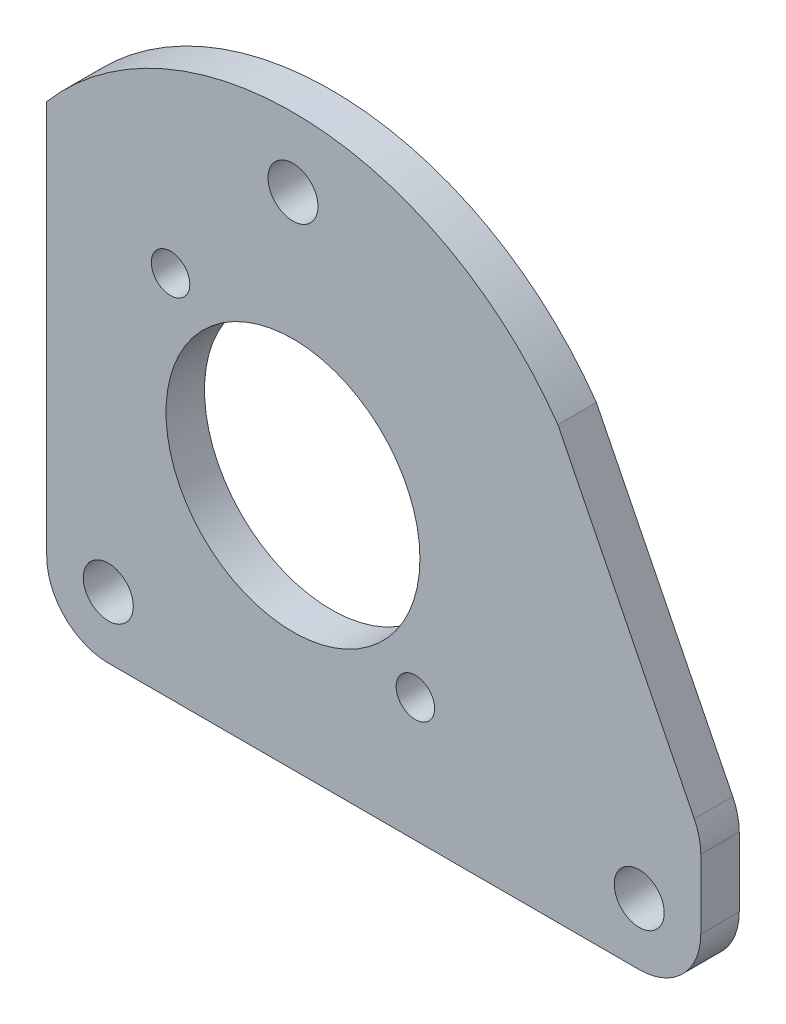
ISO-10303-21;
HEADER;
FILE_DESCRIPTION(('STEP AP214'),'2;1');
FILE_NAME('part.step','',(''),(''),'','','');
FILE_SCHEMA(('AUTOMOTIVE_DESIGN { 1 0 10303 214 1 1 1 1 }'));
ENDSEC;
DATA;
#1=APPLICATION_CONTEXT('core data for automotive mechanical design processes');
#2=APPLICATION_PROTOCOL_DEFINITION('international standard','automotive_design',2000,#1);
#3=PRODUCT_CONTEXT('',#1,'mechanical');
#4=PRODUCT('Part','Part','',(#3));
#5=PRODUCT_RELATED_PRODUCT_CATEGORY('part','',(#4));
#6=PRODUCT_DEFINITION_FORMATION('','',#4);
#7=PRODUCT_DEFINITION_CONTEXT('part definition',#1,'design');
#8=PRODUCT_DEFINITION('design','',#6,#7);
#9=PRODUCT_DEFINITION_SHAPE('','',#8);
#10=(LENGTH_UNIT() NAMED_UNIT(*) SI_UNIT(.MILLI.,.METRE.));
#11=(NAMED_UNIT(*) PLANE_ANGLE_UNIT() SI_UNIT($,.RADIAN.));
#12=(NAMED_UNIT(*) SI_UNIT($,.STERADIAN.) SOLID_ANGLE_UNIT());
#13=UNCERTAINTY_MEASURE_WITH_UNIT(LENGTH_MEASURE(1.E-05),#10,'distance_accuracy_value','');
#14=(GEOMETRIC_REPRESENTATION_CONTEXT(3) GLOBAL_UNCERTAINTY_ASSIGNED_CONTEXT((#13)) GLOBAL_UNIT_ASSIGNED_CONTEXT((#10,
#11,#12)) REPRESENTATION_CONTEXT('',''));
#15=CARTESIAN_POINT('',(0.,0.,0.));
#16=DIRECTION('',(0.,0.,1.));
#17=DIRECTION('',(1.,0.,0.));
#18=AXIS2_PLACEMENT_3D('',#15,#16,#17);
#19=CARTESIAN_POINT('',(-6.69608691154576,-0.438281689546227,0.));
#20=DIRECTION('',(0.,0.,1.));
#21=DIRECTION('',(1.,0.,0.));
#22=AXIS2_PLACEMENT_3D('',#19,#20,#21);
#23=PLANE('',#22);
#24=CARTESIAN_POINT('',(-13.5,0.,0.));
#25=DIRECTION('',(0.,0.,1.));
#26=DIRECTION('',(1.,0.,0.));
#27=AXIS2_PLACEMENT_3D('',#24,#25,#26);
#28=CIRCLE('',#27,42.);
#29=CARTESIAN_POINT('',(20.9268092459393,24.0581546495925,0.));
#30=VERTEX_POINT('',#29);
#31=CARTESIAN_POINT('',(-45.5,27.2029410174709,0.));
#32=VERTEX_POINT('',#31);
#33=EDGE_CURVE('E81',#30,#32,#28,.T.);
#34=ORIENTED_EDGE('',*,*,#33,.F.);
#35=DIRECTION('',(-0.446727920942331,0.894669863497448,0.));
#36=VECTOR('',#35,1.);
#37=CARTESIAN_POINT('',(20.9268092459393,24.0581546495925,0.));
#38=LINE('',#37,#36);
#39=CARTESIAN_POINT('',(38.6573589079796,-11.4511289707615,0.));
#40=VERTEX_POINT('',#39);
#41=EDGE_CURVE('E86',#40,#30,#38,.T.);
#42=ORIENTED_EDGE('',*,*,#41,.F.);
#43=CARTESIAN_POINT('',(31.5,-15.0249523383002,0.));
#44=DIRECTION('',(0.,0.,1.));
#45=DIRECTION('',(1.,0.,0.));
#46=AXIS2_PLACEMENT_3D('',#43,#44,#45);
#47=CIRCLE('',#46,7.99999999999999);
#48=CARTESIAN_POINT('',(39.5,-15.0249523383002,0.));
#49=VERTEX_POINT('',#48);
#50=EDGE_CURVE('E104',#49,#40,#47,.T.);
#51=ORIENTED_EDGE('',*,*,#50,.F.);
#52=DIRECTION('',(0.,1.,0.));
#53=VECTOR('',#52,1.);
#54=CARTESIAN_POINT('',(39.5,-15.0249523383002,0.));
#55=LINE('',#54,#53);
#56=CARTESIAN_POINT('',(39.5,-24.,0.));
#57=VERTEX_POINT('',#56);
#58=EDGE_CURVE('E109',#57,#49,#55,.T.);
#59=ORIENTED_EDGE('',*,*,#58,.F.);
#60=CARTESIAN_POINT('',(31.5,-24.,0.));
#61=DIRECTION('',(0.,0.,1.));
#62=DIRECTION('',(1.,0.,0.));
#63=AXIS2_PLACEMENT_3D('',#60,#61,#62);
#64=CIRCLE('',#63,8.);
#65=CARTESIAN_POINT('',(31.5,-32.,0.));
#66=VERTEX_POINT('',#65);
#67=EDGE_CURVE('E149',#66,#57,#64,.T.);
#68=ORIENTED_EDGE('',*,*,#67,.F.);
#69=DIRECTION('',(1.,0.,0.));
#70=VECTOR('',#69,1.);
#71=CARTESIAN_POINT('',(31.5,-32.,0.));
#72=LINE('',#71,#70);
#73=CARTESIAN_POINT('',(-37.5,-32.,0.));
#74=VERTEX_POINT('',#73);
#75=EDGE_CURVE('E113',#74,#66,#72,.T.);
#76=ORIENTED_EDGE('',*,*,#75,.F.);
#77=CARTESIAN_POINT('',(-37.5,-24.,0.));
#78=DIRECTION('',(0.,0.,1.));
#79=DIRECTION('',(1.,0.,0.));
#80=AXIS2_PLACEMENT_3D('',#77,#78,#79);
#81=CIRCLE('',#80,7.99999999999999);
#82=CARTESIAN_POINT('',(-45.5,-24.,0.));
#83=VERTEX_POINT('',#82);
#84=EDGE_CURVE('E151',#83,#74,#81,.T.);
#85=ORIENTED_EDGE('',*,*,#84,.F.);
#86=DIRECTION('',(0.,-1.,0.));
#87=VECTOR('',#86,1.);
#88=CARTESIAN_POINT('',(-45.5,-24.,0.));
#89=LINE('',#88,#87);
#90=EDGE_CURVE('E88',#32,#83,#89,.T.);
#91=ORIENTED_EDGE('',*,*,#90,.F.);
#92=EDGE_LOOP('',(#34,#42,#51,#59,#68,#76,#85,#91));
#93=FACE_BOUND('',#92,.T.);
#94=CARTESIAN_POINT('',(-29.4099025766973,15.9099025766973,0.));
#95=DIRECTION('',(0.,0.,1.));
#96=DIRECTION('',(1.,0.,0.));
#97=AXIS2_PLACEMENT_3D('',#94,#95,#96);
#98=CIRCLE('',#97,2.5);
#99=CARTESIAN_POINT('',(-26.9099025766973,15.9099025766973,0.));
#100=VERTEX_POINT('',#99);
#101=EDGE_CURVE('E92',#100,#100,#98,.T.);
#102=ORIENTED_EDGE('',*,*,#101,.T.);
#103=EDGE_LOOP('',(#102));
#104=FACE_BOUND('',#103,.T.);
#105=CARTESIAN_POINT('',(2.40990257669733,-15.9099025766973,0.));
#106=DIRECTION('',(0.,0.,1.));
#107=DIRECTION('',(1.,0.,0.));
#108=AXIS2_PLACEMENT_3D('',#105,#106,#107);
#109=CIRCLE('',#108,2.5);
#110=CARTESIAN_POINT('',(4.90990257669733,-15.9099025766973,0.));
#111=VERTEX_POINT('',#110);
#112=EDGE_CURVE('E155',#111,#111,#109,.T.);
#113=ORIENTED_EDGE('',*,*,#112,.T.);
#114=EDGE_LOOP('',(#113));
#115=FACE_BOUND('',#114,.T.);
#116=CARTESIAN_POINT('',(-37.5,-24.,0.));
#117=DIRECTION('',(0.,0.,1.));
#118=DIRECTION('',(1.,0.,0.));
#119=AXIS2_PLACEMENT_3D('',#116,#117,#118);
#120=CIRCLE('',#119,3.25);
#121=CARTESIAN_POINT('',(-34.25,-24.,0.));
#122=VERTEX_POINT('',#121);
#123=EDGE_CURVE('E158',#122,#122,#120,.T.);
#124=ORIENTED_EDGE('',*,*,#123,.T.);
#125=EDGE_LOOP('',(#124));
#126=FACE_BOUND('',#125,.T.);
#127=CARTESIAN_POINT('',(31.5,-24.,0.));
#128=DIRECTION('',(0.,0.,1.));
#129=DIRECTION('',(1.,0.,0.));
#130=AXIS2_PLACEMENT_3D('',#127,#128,#129);
#131=CIRCLE('',#130,3.25);
#132=CARTESIAN_POINT('',(34.75,-24.,0.));
#133=VERTEX_POINT('',#132);
#134=EDGE_CURVE('E161',#133,#133,#131,.T.);
#135=ORIENTED_EDGE('',*,*,#134,.T.);
#136=EDGE_LOOP('',(#135));
#137=FACE_BOUND('',#136,.T.);
#138=CARTESIAN_POINT('',(-13.5,33.,0.));
#139=DIRECTION('',(0.,0.,1.));
#140=DIRECTION('',(1.,0.,0.));
#141=AXIS2_PLACEMENT_3D('',#138,#139,#140);
#142=CIRCLE('',#141,3.25);
#143=CARTESIAN_POINT('',(-10.25,33.,0.));
#144=VERTEX_POINT('',#143);
#145=EDGE_CURVE('E163',#144,#144,#142,.T.);
#146=ORIENTED_EDGE('',*,*,#145,.T.);
#147=EDGE_LOOP('',(#146));
#148=FACE_BOUND('',#147,.T.);
#149=CARTESIAN_POINT('',(-13.5,0.,0.));
#150=DIRECTION('',(0.,0.,1.));
#151=DIRECTION('',(1.,0.,0.));
#152=AXIS2_PLACEMENT_3D('',#149,#150,#151);
#153=CIRCLE('',#152,16.5);
#154=CARTESIAN_POINT('',(3.,0.,0.));
#155=VERTEX_POINT('',#154);
#156=EDGE_CURVE('E21',#155,#155,#153,.T.);
#157=ORIENTED_EDGE('',*,*,#156,.T.);
#158=EDGE_LOOP('',(#157));
#159=FACE_BOUND('',#158,.T.);
#160=ADVANCED_FACE('F17',(#93,#104,#115,#126,#137,#148,#159),#23,.F.);
#161=CARTESIAN_POINT('',(-13.5,0.,0.));
#162=DIRECTION('',(0.,0.,1.));
#163=DIRECTION('',(1.,0.,0.));
#164=AXIS2_PLACEMENT_3D('',#161,#162,#163);
#165=CYLINDRICAL_SURFACE('',#164,16.5);
#166=ORIENTED_EDGE('',*,*,#156,.F.);
#167=EDGE_LOOP('',(#166));
#168=FACE_BOUND('',#167,.T.);
#169=CARTESIAN_POINT('',(-13.5,0.,5.));
#170=DIRECTION('',(0.,0.,1.));
#171=DIRECTION('',(1.,0.,0.));
#172=AXIS2_PLACEMENT_3D('',#169,#170,#171);
#173=CIRCLE('',#172,16.5);
#174=CARTESIAN_POINT('',(3.,0.,5.));
#175=VERTEX_POINT('',#174);
#176=EDGE_CURVE('E100',#175,#175,#173,.F.);
#177=ORIENTED_EDGE('',*,*,#176,.F.);
#178=EDGE_LOOP('',(#177));
#179=FACE_BOUND('',#178,.T.);
#180=ADVANCED_FACE('F171',(#168,#179),#165,.F.);
#181=CARTESIAN_POINT('',(-13.5,33.,0.));
#182=DIRECTION('',(0.,0.,1.));
#183=DIRECTION('',(1.,0.,0.));
#184=AXIS2_PLACEMENT_3D('',#181,#182,#183);
#185=CYLINDRICAL_SURFACE('',#184,3.25);
#186=ORIENTED_EDGE('',*,*,#145,.F.);
#187=EDGE_LOOP('',(#186));
#188=FACE_BOUND('',#187,.T.);
#189=CARTESIAN_POINT('',(-13.5,33.,5.));
#190=DIRECTION('',(0.,0.,1.));
#191=DIRECTION('',(1.,0.,0.));
#192=AXIS2_PLACEMENT_3D('',#189,#190,#191);
#193=CIRCLE('',#192,3.25);
#194=CARTESIAN_POINT('',(-10.25,33.,5.));
#195=VERTEX_POINT('',#194);
#196=EDGE_CURVE('E143',#195,#195,#193,.F.);
#197=ORIENTED_EDGE('',*,*,#196,.F.);
#198=EDGE_LOOP('',(#197));
#199=FACE_BOUND('',#198,.T.);
#200=ADVANCED_FACE('F174',(#188,#199),#185,.F.);
#201=CARTESIAN_POINT('',(31.5,-24.,0.));
#202=DIRECTION('',(0.,0.,1.));
#203=DIRECTION('',(1.,0.,0.));
#204=AXIS2_PLACEMENT_3D('',#201,#202,#203);
#205=CYLINDRICAL_SURFACE('',#204,3.25);
#206=ORIENTED_EDGE('',*,*,#134,.F.);
#207=EDGE_LOOP('',(#206));
#208=FACE_BOUND('',#207,.T.);
#209=CARTESIAN_POINT('',(31.5,-24.,5.));
#210=DIRECTION('',(0.,0.,1.));
#211=DIRECTION('',(1.,0.,0.));
#212=AXIS2_PLACEMENT_3D('',#209,#210,#211);
#213=CIRCLE('',#212,3.25);
#214=CARTESIAN_POINT('',(34.75,-24.,5.));
#215=VERTEX_POINT('',#214);
#216=EDGE_CURVE('E140',#215,#215,#213,.F.);
#217=ORIENTED_EDGE('',*,*,#216,.F.);
#218=EDGE_LOOP('',(#217));
#219=FACE_BOUND('',#218,.T.);
#220=ADVANCED_FACE('F198',(#208,#219),#205,.F.);
#221=CARTESIAN_POINT('',(-37.5,-24.,0.));
#222=DIRECTION('',(0.,0.,1.));
#223=DIRECTION('',(1.,0.,0.));
#224=AXIS2_PLACEMENT_3D('',#221,#222,#223);
#225=CYLINDRICAL_SURFACE('',#224,3.25);
#226=ORIENTED_EDGE('',*,*,#123,.F.);
#227=EDGE_LOOP('',(#226));
#228=FACE_BOUND('',#227,.T.);
#229=CARTESIAN_POINT('',(-37.5,-24.,5.));
#230=DIRECTION('',(0.,0.,1.));
#231=DIRECTION('',(1.,0.,0.));
#232=AXIS2_PLACEMENT_3D('',#229,#230,#231);
#233=CIRCLE('',#232,3.25);
#234=CARTESIAN_POINT('',(-34.25,-24.,5.));
#235=VERTEX_POINT('',#234);
#236=EDGE_CURVE('E137',#235,#235,#233,.F.);
#237=ORIENTED_EDGE('',*,*,#236,.F.);
#238=EDGE_LOOP('',(#237));
#239=FACE_BOUND('',#238,.T.);
#240=ADVANCED_FACE('F204',(#228,#239),#225,.F.);
#241=CARTESIAN_POINT('',(2.40990257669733,-15.9099025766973,0.));
#242=DIRECTION('',(0.,0.,1.));
#243=DIRECTION('',(1.,0.,0.));
#244=AXIS2_PLACEMENT_3D('',#241,#242,#243);
#245=CYLINDRICAL_SURFACE('',#244,2.5);
#246=ORIENTED_EDGE('',*,*,#112,.F.);
#247=EDGE_LOOP('',(#246));
#248=FACE_BOUND('',#247,.T.);
#249=CARTESIAN_POINT('',(2.40990257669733,-15.9099025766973,5.));
#250=DIRECTION('',(0.,0.,1.));
#251=DIRECTION('',(1.,0.,0.));
#252=AXIS2_PLACEMENT_3D('',#249,#250,#251);
#253=CIRCLE('',#252,2.5);
#254=CARTESIAN_POINT('',(4.90990257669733,-15.9099025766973,5.));
#255=VERTEX_POINT('',#254);
#256=EDGE_CURVE('E134',#255,#255,#253,.F.);
#257=ORIENTED_EDGE('',*,*,#256,.F.);
#258=EDGE_LOOP('',(#257));
#259=FACE_BOUND('',#258,.T.);
#260=ADVANCED_FACE('F211',(#248,#259),#245,.F.);
#261=CARTESIAN_POINT('',(-29.4099025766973,15.9099025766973,0.));
#262=DIRECTION('',(0.,0.,1.));
#263=DIRECTION('',(1.,0.,0.));
#264=AXIS2_PLACEMENT_3D('',#261,#262,#263);
#265=CYLINDRICAL_SURFACE('',#264,2.5);
#266=ORIENTED_EDGE('',*,*,#101,.F.);
#267=EDGE_LOOP('',(#266));
#268=FACE_BOUND('',#267,.T.);
#269=CARTESIAN_POINT('',(-29.4099025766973,15.9099025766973,5.));
#270=DIRECTION('',(0.,0.,1.));
#271=DIRECTION('',(1.,0.,0.));
#272=AXIS2_PLACEMENT_3D('',#269,#270,#271);
#273=CIRCLE('',#272,2.5);
#274=CARTESIAN_POINT('',(-26.9099025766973,15.9099025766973,5.));
#275=VERTEX_POINT('',#274);
#276=EDGE_CURVE('E131',#275,#275,#273,.F.);
#277=ORIENTED_EDGE('',*,*,#276,.F.);
#278=EDGE_LOOP('',(#277));
#279=FACE_BOUND('',#278,.T.);
#280=ADVANCED_FACE('F215',(#268,#279),#265,.F.);
#281=CARTESIAN_POINT('',(-13.5,0.,0.));
#282=DIRECTION('',(0.,0.,1.));
#283=DIRECTION('',(1.,0.,0.));
#284=AXIS2_PLACEMENT_3D('',#281,#282,#283);
#285=CYLINDRICAL_SURFACE('',#284,42.);
#286=ORIENTED_EDGE('',*,*,#33,.T.);
#287=DIRECTION('',(0.,0.,1.));
#288=VECTOR('',#287,1.);
#289=CARTESIAN_POINT('',(-45.5,27.2029410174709,0.));
#290=LINE('',#289,#288);
#291=CARTESIAN_POINT('',(-45.5,27.2029410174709,5.));
#292=VERTEX_POINT('',#291);
#293=EDGE_CURVE('E91',#292,#32,#290,.F.);
#294=ORIENTED_EDGE('',*,*,#293,.F.);
#295=CARTESIAN_POINT('',(-13.5,0.,5.));
#296=DIRECTION('',(0.,0.,1.));
#297=DIRECTION('',(1.,0.,0.));
#298=AXIS2_PLACEMENT_3D('',#295,#296,#297);
#299=CIRCLE('',#298,42.);
#300=CARTESIAN_POINT('',(20.9268092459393,24.0581546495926,5.));
#301=VERTEX_POINT('',#300);
#302=EDGE_CURVE('E98',#301,#292,#299,.T.);
#303=ORIENTED_EDGE('',*,*,#302,.F.);
#304=DIRECTION('',(0.,0.,1.));
#305=VECTOR('',#304,1.);
#306=CARTESIAN_POINT('',(20.9268092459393,24.0581546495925,0.));
#307=LINE('',#306,#305);
#308=EDGE_CURVE('E95',#30,#301,#307,.T.);
#309=ORIENTED_EDGE('',*,*,#308,.F.);
#310=EDGE_LOOP('',(#286,#294,#303,#309));
#311=FACE_BOUND('',#310,.T.);
#312=ADVANCED_FACE('F96',(#311),#285,.T.);
#313=CARTESIAN_POINT('',(-45.5,-24.,0.));
#314=DIRECTION('',(-1.,0.,0.));
#315=DIRECTION('',(0.,-1.,0.));
#316=AXIS2_PLACEMENT_3D('',#313,#314,#315);
#317=PLANE('',#316);
#318=ORIENTED_EDGE('',*,*,#90,.T.);
#319=DIRECTION('',(0.,0.,1.));
#320=VECTOR('',#319,1.);
#321=CARTESIAN_POINT('',(-45.5,-24.,0.));
#322=LINE('',#321,#320);
#323=CARTESIAN_POINT('',(-45.5,-24.,5.));
#324=VERTEX_POINT('',#323);
#325=EDGE_CURVE('E118',#324,#83,#322,.F.);
#326=ORIENTED_EDGE('',*,*,#325,.F.);
#327=DIRECTION('',(0.,1.,0.));
#328=VECTOR('',#327,1.);
#329=CARTESIAN_POINT('',(-45.5,-0.438281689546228,5.));
#330=LINE('',#329,#328);
#331=EDGE_CURVE('E129',#292,#324,#330,.F.);
#332=ORIENTED_EDGE('',*,*,#331,.F.);
#333=ORIENTED_EDGE('',*,*,#293,.T.);
#334=EDGE_LOOP('',(#318,#326,#332,#333));
#335=FACE_BOUND('',#334,.T.);
#336=ADVANCED_FACE('F222',(#335),#317,.T.);
#337=CARTESIAN_POINT('',(-37.5,-24.,0.));
#338=DIRECTION('',(0.,0.,1.));
#339=DIRECTION('',(1.,0.,0.));
#340=AXIS2_PLACEMENT_3D('',#337,#338,#339);
#341=CYLINDRICAL_SURFACE('',#340,7.99999999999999);
#342=ORIENTED_EDGE('',*,*,#84,.T.);
#343=DIRECTION('',(0.,0.,1.));
#344=VECTOR('',#343,1.);
#345=CARTESIAN_POINT('',(-37.5,-32.,0.));
#346=LINE('',#345,#344);
#347=CARTESIAN_POINT('',(-37.5,-32.,5.));
#348=VERTEX_POINT('',#347);
#349=EDGE_CURVE('E116',#348,#74,#346,.F.);
#350=ORIENTED_EDGE('',*,*,#349,.F.);
#351=CARTESIAN_POINT('',(-37.5,-24.,5.));
#352=DIRECTION('',(0.,0.,1.));
#353=DIRECTION('',(1.,0.,0.));
#354=AXIS2_PLACEMENT_3D('',#351,#352,#353);
#355=CIRCLE('',#354,7.99999999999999);
#356=EDGE_CURVE('E126',#324,#348,#355,.T.);
#357=ORIENTED_EDGE('',*,*,#356,.F.);
#358=ORIENTED_EDGE('',*,*,#325,.T.);
#359=EDGE_LOOP('',(#342,#350,#357,#358));
#360=FACE_BOUND('',#359,.T.);
#361=ADVANCED_FACE('F225',(#360),#341,.T.);
#362=CARTESIAN_POINT('',(31.5,-32.,0.));
#363=DIRECTION('',(0.,-1.,0.));
#364=DIRECTION('',(1.,0.,0.));
#365=AXIS2_PLACEMENT_3D('',#362,#363,#364);
#366=PLANE('',#365);
#367=ORIENTED_EDGE('',*,*,#75,.T.);
#368=DIRECTION('',(0.,0.,1.));
#369=VECTOR('',#368,1.);
#370=CARTESIAN_POINT('',(31.5,-32.,0.));
#371=LINE('',#370,#369);
#372=CARTESIAN_POINT('',(31.5,-32.,5.));
#373=VERTEX_POINT('',#372);
#374=EDGE_CURVE('E115',#373,#66,#371,.F.);
#375=ORIENTED_EDGE('',*,*,#374,.F.);
#376=DIRECTION('',(1.,0.,0.));
#377=VECTOR('',#376,1.);
#378=CARTESIAN_POINT('',(-6.69608691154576,-32.,5.));
#379=LINE('',#378,#377);
#380=EDGE_CURVE('E125',#348,#373,#379,.T.);
#381=ORIENTED_EDGE('',*,*,#380,.F.);
#382=ORIENTED_EDGE('',*,*,#349,.T.);
#383=EDGE_LOOP('',(#367,#375,#381,#382));
#384=FACE_BOUND('',#383,.T.);
#385=ADVANCED_FACE('F229',(#384),#366,.T.);
#386=CARTESIAN_POINT('',(31.5,-24.,0.));
#387=DIRECTION('',(0.,0.,1.));
#388=DIRECTION('',(1.,0.,0.));
#389=AXIS2_PLACEMENT_3D('',#386,#387,#388);
#390=CYLINDRICAL_SURFACE('',#389,8.);
#391=ORIENTED_EDGE('',*,*,#67,.T.);
#392=DIRECTION('',(0.,0.,-1.));
#393=VECTOR('',#392,1.);
#394=CARTESIAN_POINT('',(39.5,-24.,0.));
#395=LINE('',#394,#393);
#396=CARTESIAN_POINT('',(39.5,-24.,5.));
#397=VERTEX_POINT('',#396);
#398=EDGE_CURVE('E112',#397,#57,#395,.T.);
#399=ORIENTED_EDGE('',*,*,#398,.F.);
#400=CARTESIAN_POINT('',(31.5,-24.,5.));
#401=DIRECTION('',(0.,0.,1.));
#402=DIRECTION('',(1.,0.,0.));
#403=AXIS2_PLACEMENT_3D('',#400,#401,#402);
#404=CIRCLE('',#403,8.);
#405=EDGE_CURVE('E122',#373,#397,#404,.T.);
#406=ORIENTED_EDGE('',*,*,#405,.F.);
#407=ORIENTED_EDGE('',*,*,#374,.T.);
#408=EDGE_LOOP('',(#391,#399,#406,#407));
#409=FACE_BOUND('',#408,.T.);
#410=ADVANCED_FACE('F233',(#409),#390,.T.);
#411=CARTESIAN_POINT('',(39.5,-15.0249523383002,0.));
#412=DIRECTION('',(1.,0.,0.));
#413=DIRECTION('',(0.,0.,-1.));
#414=AXIS2_PLACEMENT_3D('',#411,#412,#413);
#415=PLANE('',#414);
#416=ORIENTED_EDGE('',*,*,#58,.T.);
#417=DIRECTION('',(0.,0.,1.));
#418=VECTOR('',#417,1.);
#419=CARTESIAN_POINT('',(39.5,-15.0249523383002,0.));
#420=LINE('',#419,#418);
#421=CARTESIAN_POINT('',(39.5,-15.0249523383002,5.));
#422=VERTEX_POINT('',#421);
#423=EDGE_CURVE('E111',#422,#49,#420,.F.);
#424=ORIENTED_EDGE('',*,*,#423,.F.);
#425=DIRECTION('',(0.,1.,0.));
#426=VECTOR('',#425,1.);
#427=CARTESIAN_POINT('',(39.5,-0.438281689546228,5.));
#428=LINE('',#427,#426);
#429=EDGE_CURVE('E121',#397,#422,#428,.T.);
#430=ORIENTED_EDGE('',*,*,#429,.F.);
#431=ORIENTED_EDGE('',*,*,#398,.T.);
#432=EDGE_LOOP('',(#416,#424,#430,#431));
#433=FACE_BOUND('',#432,.T.);
#434=ADVANCED_FACE('F237',(#433),#415,.T.);
#435=CARTESIAN_POINT('',(31.5,-15.0249523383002,0.));
#436=DIRECTION('',(0.,0.,1.));
#437=DIRECTION('',(1.,0.,0.));
#438=AXIS2_PLACEMENT_3D('',#435,#436,#437);
#439=CYLINDRICAL_SURFACE('',#438,7.99999999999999);
#440=ORIENTED_EDGE('',*,*,#50,.T.);
#441=DIRECTION('',(0.,0.,1.));
#442=VECTOR('',#441,1.);
#443=CARTESIAN_POINT('',(38.6573589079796,-11.4511289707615,0.));
#444=LINE('',#443,#442);
#445=CARTESIAN_POINT('',(38.6573589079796,-11.4511289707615,5.));
#446=VERTEX_POINT('',#445);
#447=EDGE_CURVE('E36',#446,#40,#444,.F.);
#448=ORIENTED_EDGE('',*,*,#447,.F.);
#449=CARTESIAN_POINT('',(31.5,-15.0249523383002,5.));
#450=DIRECTION('',(0.,0.,1.));
#451=DIRECTION('',(1.,0.,0.));
#452=AXIS2_PLACEMENT_3D('',#449,#450,#451);
#453=CIRCLE('',#452,7.99999999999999);
#454=EDGE_CURVE('E27',#422,#446,#453,.T.);
#455=ORIENTED_EDGE('',*,*,#454,.F.);
#456=ORIENTED_EDGE('',*,*,#423,.T.);
#457=EDGE_LOOP('',(#440,#448,#455,#456));
#458=FACE_BOUND('',#457,.T.);
#459=ADVANCED_FACE('F184',(#458),#439,.T.);
#460=CARTESIAN_POINT('',(20.9268092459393,24.0581546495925,0.));
#461=DIRECTION('',(0.894669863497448,0.446727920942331,0.));
#462=DIRECTION('',(-0.446727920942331,0.894669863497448,0.));
#463=AXIS2_PLACEMENT_3D('',#460,#461,#462);
#464=PLANE('',#463);
#465=ORIENTED_EDGE('',*,*,#41,.T.);
#466=ORIENTED_EDGE('',*,*,#308,.T.);
#467=DIRECTION('',(-0.446727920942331,0.894669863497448,0.));
#468=VECTOR('',#467,1.);
#469=CARTESIAN_POINT('',(38.6573589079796,-11.4511289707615,5.));
#470=LINE('',#469,#468);
#471=EDGE_CURVE('E11',#446,#301,#470,.T.);
#472=ORIENTED_EDGE('',*,*,#471,.F.);
#473=ORIENTED_EDGE('',*,*,#447,.T.);
#474=EDGE_LOOP('',(#465,#466,#472,#473));
#475=FACE_BOUND('',#474,.T.);
#476=ADVANCED_FACE('F102',(#475),#464,.T.);
#477=CARTESIAN_POINT('',(-6.69608691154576,-0.438281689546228,5.));
#478=DIRECTION('',(0.,0.,1.));
#479=DIRECTION('',(1.,0.,0.));
#480=AXIS2_PLACEMENT_3D('',#477,#478,#479);
#481=PLANE('',#480);
#482=ORIENTED_EDGE('',*,*,#454,.T.);
#483=ORIENTED_EDGE('',*,*,#471,.T.);
#484=ORIENTED_EDGE('',*,*,#302,.T.);
#485=ORIENTED_EDGE('',*,*,#331,.T.);
#486=ORIENTED_EDGE('',*,*,#356,.T.);
#487=ORIENTED_EDGE('',*,*,#380,.T.);
#488=ORIENTED_EDGE('',*,*,#405,.T.);
#489=ORIENTED_EDGE('',*,*,#429,.T.);
#490=EDGE_LOOP('',(#482,#483,#484,#485,#486,#487,#488,#489));
#491=FACE_BOUND('',#490,.T.);
#492=ORIENTED_EDGE('',*,*,#276,.T.);
#493=EDGE_LOOP('',(#492));
#494=FACE_BOUND('',#493,.T.);
#495=ORIENTED_EDGE('',*,*,#256,.T.);
#496=EDGE_LOOP('',(#495));
#497=FACE_BOUND('',#496,.T.);
#498=ORIENTED_EDGE('',*,*,#236,.T.);
#499=EDGE_LOOP('',(#498));
#500=FACE_BOUND('',#499,.T.);
#501=ORIENTED_EDGE('',*,*,#216,.T.);
#502=EDGE_LOOP('',(#501));
#503=FACE_BOUND('',#502,.T.);
#504=ORIENTED_EDGE('',*,*,#196,.T.);
#505=EDGE_LOOP('',(#504));
#506=FACE_BOUND('',#505,.T.);
#507=ORIENTED_EDGE('',*,*,#176,.T.);
#508=EDGE_LOOP('',(#507));
#509=FACE_BOUND('',#508,.T.);
#510=ADVANCED_FACE('F19',(#491,#494,#497,#500,#503,#506,#509),#481,.T.);
#511=CLOSED_SHELL('',(#160,#180,#200,#220,#240,#260,#280,#312,#336,#361,#385,#410,#434,#459,
#476,#510));
#512=MANIFOLD_SOLID_BREP('B1',#511);
#513=ADVANCED_BREP_SHAPE_REPRESENTATION('',(#18,#512),#14);
#514=SHAPE_DEFINITION_REPRESENTATION(#9,#513);
ENDSEC;
END-ISO-10303-21;
